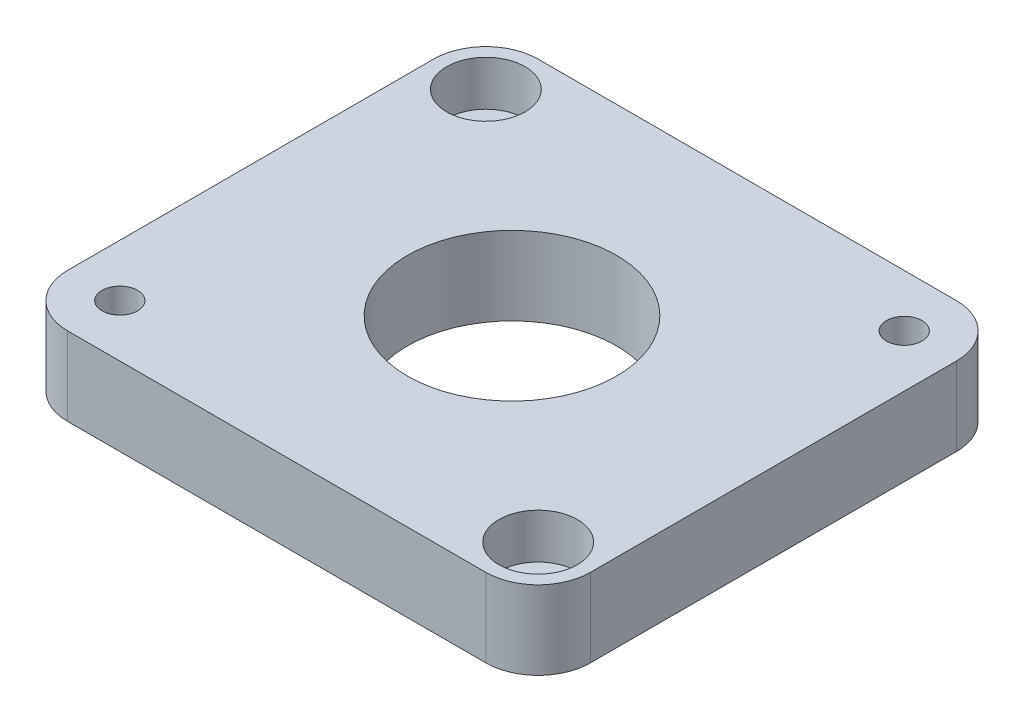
from build123d import *

# Parameters (mm, degrees)
AUFSATZ_LINEAR_AUSTRAGEN1_DEPTH                      = 15
SKIZZE2_R                                            = 20
SCHNITT_LINEAR_AUSTRAGEN1_DEPTH                      = 69.92024376
STIRNSENKUNG_F_R_M8_ZYLINDERSCHRAUBE_MIT_D           = 9
STIRNSENKUNG_F_R_M8_ZYLINDERSCHRAUBE_MIT_CBORE_D     = 15
STIRNSENKUNG_F_R_M8_ZYLINDERSCHRAUBE_MIT_CBORE_DEPTH = 8.6
M8_GEWINDEBOHRUNG1_D                                 = 6.8


with BuildPart() as part:
    # Skizze1 → Aufsatz-Linear austragen1 (new body)
    with BuildSketch(Plane(origin=(0, 0, 0), x_dir=(1, 0, 0), z_dir=(0, 1, 0))):
        with BuildLine():
            Line((-40, 45), (40, 45))
            ThreePointArc((40, 45), (47.071067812, 42.071067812), (50, 35))
            Line((50, 35), (50, -35))
            ThreePointArc((50, -35), (47.071067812, -42.071067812), (40, -45))
            Line((40, -45), (-40, -45))
            ThreePointArc((-40, -45), (-47.071067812, -42.071067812), (-50, -35))
            Line((-50, -35), (-50, 35))
            ThreePointArc((-50, 35), (-47.071067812, 42.071067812), (-40, 45))
        make_face()
    extrude(amount=AUFSATZ_LINEAR_AUSTRAGEN1_DEPTH)

    # Skizze2 → Schnitt-Linear austragen1 (cut, through all)
    with BuildSketch(Plane(origin=(0, 15, 0), x_dir=(1, 0, 0), z_dir=(0, 1, 0))):
        with Locations(Location((0, 0, 0), (0, 0, 270))):
            Circle(SKIZZE2_R)
    extrude(amount=-SCHNITT_LINEAR_AUSTRAGEN1_DEPTH, mode=Mode.SUBTRACT)

    # Stirnsenkung f_r M8 Zylinderschraube mit (through all)
    with Locations(Plane(origin=(-40, 15, -35), x_dir=(0, 0, 1), z_dir=(0, 1, 0))):
        with Locations((0, 0), (70, 80)):
            CounterBoreHole(STIRNSENKUNG_F_R_M8_ZYLINDERSCHRAUBE_MIT_D / 2, STIRNSENKUNG_F_R_M8_ZYLINDERSCHRAUBE_MIT_CBORE_D / 2, STIRNSENKUNG_F_R_M8_ZYLINDERSCHRAUBE_MIT_CBORE_DEPTH)

    # M8 Gewindebohrung1 (through all)
    with Locations(Plane(origin=(40, 15, -35), x_dir=(0, 0, 1), z_dir=(0, 1, 0))):
        with Locations((0, 0), (70, -80)):
            Hole(M8_GEWINDEBOHRUNG1_D / 2)


solid = part.part
